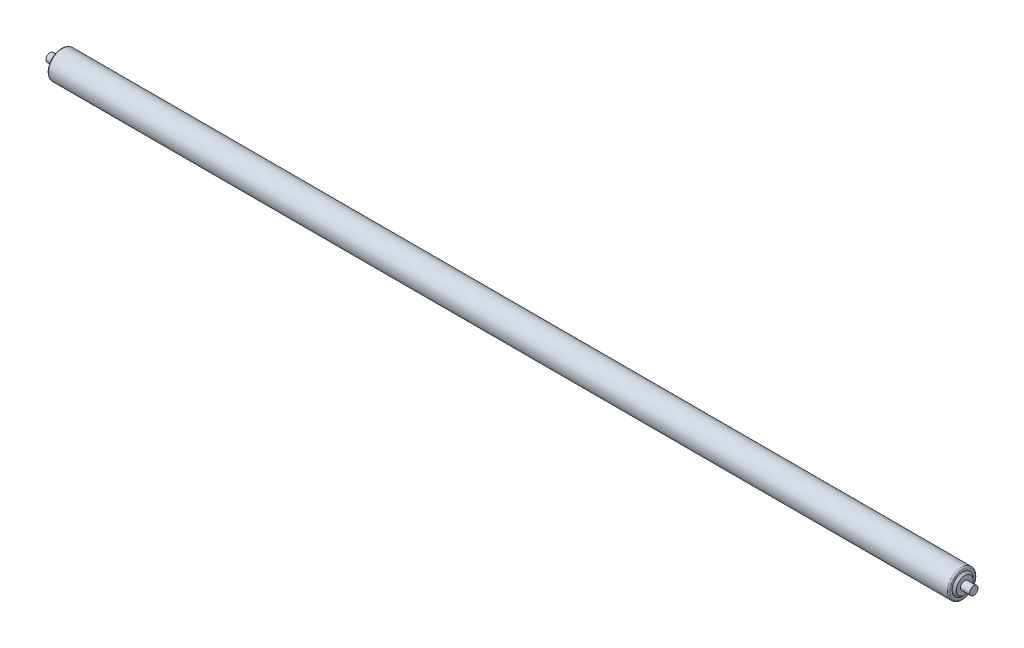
from build123d import *


with BuildPart() as part:
    # Esquisse1 → R_volution1 (revolve)
    with BuildSketch(Plane.XY, mode=Mode.PRIVATE) as r_volution1_sk:
        with BuildLine():
            Line((-321.5, 10), (321.5, 10))
            ThreePointArc((321.5, 10), (322.207106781, 9.707106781), (322.5, 9))
            Line((322.5, 9), (322.5, 7.5))
            Line((322.5, 7.5), (324, 6))
            Line((324, 6), (324, 3))
            Line((324, 3), (330.5, 3))
            Line((330.5, 3), (330.5, 0))
            Line((330.5, 0), (-330.5, 0))
            Line((-330.5, 0), (-330.5, 3))
            Line((-330.5, 3), (-325, 3))
            Line((-325, 3), (-325, 6))
            Line((-325, 6), (-322.5, 7.5))
            Line((-322.5, 7.5), (-322.5, 9))
            ThreePointArc((-322.5, 9), (-322.207106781, 9.707106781), (-321.5, 10))
        make_face()
    revolve(r_volution1_sk.sketch.rotate(Axis((330.5, 0, 0), (-1, 0, 0)), 90), axis=Axis((330.5, 0, 0), (-1, 0, 0)))


solid = part.part
